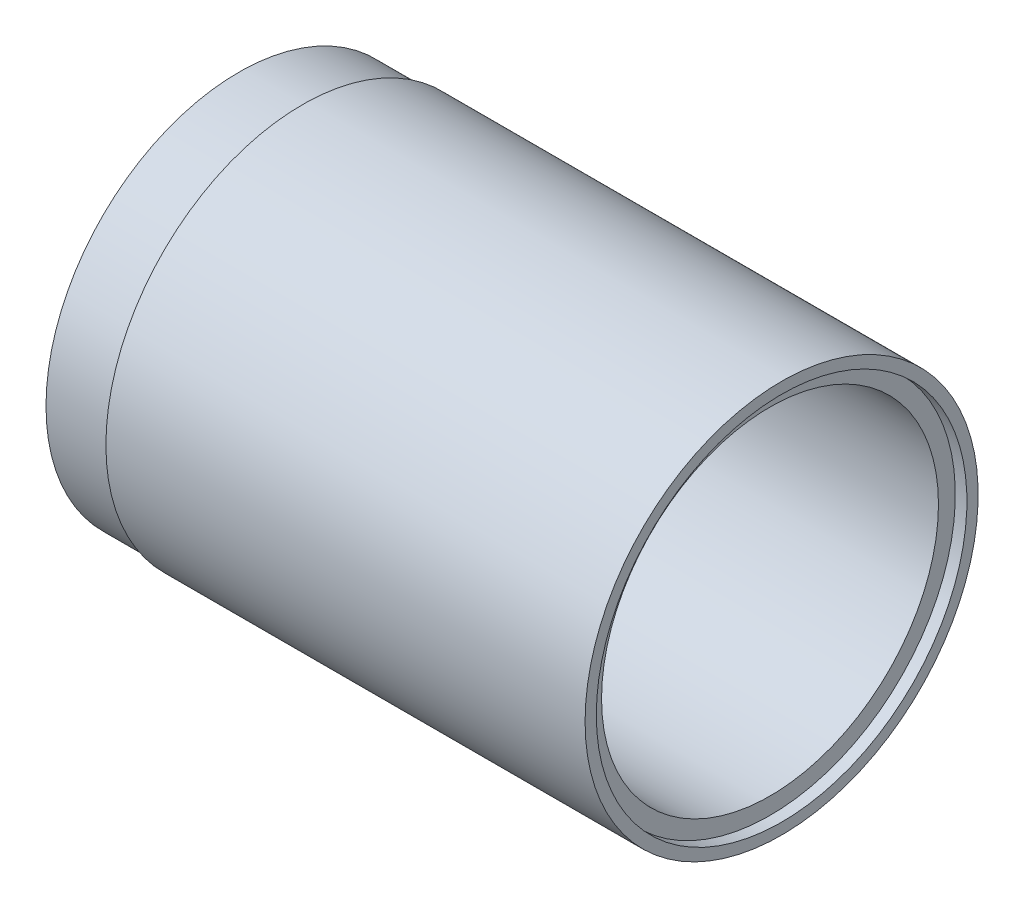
ISO-10303-21;
HEADER;
FILE_DESCRIPTION(('STEP AP214'),'2;1');
FILE_NAME('part.step','',(''),(''),'','','');
FILE_SCHEMA(('AUTOMOTIVE_DESIGN { 1 0 10303 214 1 1 1 1 }'));
ENDSEC;
DATA;
#1=APPLICATION_CONTEXT('core data for automotive mechanical design processes');
#2=APPLICATION_PROTOCOL_DEFINITION('international standard','automotive_design',2000,#1);
#3=PRODUCT_CONTEXT('',#1,'mechanical');
#4=PRODUCT('Part','Part','',(#3));
#5=PRODUCT_RELATED_PRODUCT_CATEGORY('part','',(#4));
#6=PRODUCT_DEFINITION_FORMATION('','',#4);
#7=PRODUCT_DEFINITION_CONTEXT('part definition',#1,'design');
#8=PRODUCT_DEFINITION('design','',#6,#7);
#9=PRODUCT_DEFINITION_SHAPE('','',#8);
#10=(LENGTH_UNIT() NAMED_UNIT(*) SI_UNIT(.MILLI.,.METRE.));
#11=(NAMED_UNIT(*) PLANE_ANGLE_UNIT() SI_UNIT($,.RADIAN.));
#12=(NAMED_UNIT(*) SI_UNIT($,.STERADIAN.) SOLID_ANGLE_UNIT());
#13=UNCERTAINTY_MEASURE_WITH_UNIT(LENGTH_MEASURE(1.E-05),#10,'distance_accuracy_value','');
#14=(GEOMETRIC_REPRESENTATION_CONTEXT(3) GLOBAL_UNCERTAINTY_ASSIGNED_CONTEXT((#13)) GLOBAL_UNIT_ASSIGNED_CONTEXT((#10,
#11,#12)) REPRESENTATION_CONTEXT('',''));
#15=CARTESIAN_POINT('',(0.,0.,0.));
#16=DIRECTION('',(0.,0.,1.));
#17=DIRECTION('',(1.,0.,0.));
#18=AXIS2_PLACEMENT_3D('',#15,#16,#17);
#19=CARTESIAN_POINT('',(0.,45.,0.));
#20=DIRECTION('',(1.,0.,0.));
#21=DIRECTION('',(0.,0.,-1.));
#22=AXIS2_PLACEMENT_3D('',#19,#20,#21);
#23=PLANE('',#22);
#24=CARTESIAN_POINT('',(0.,0.,0.));
#25=DIRECTION('',(-1.,0.,0.));
#26=DIRECTION('',(0.,0.,1.));
#27=AXIS2_PLACEMENT_3D('',#24,#25,#26);
#28=CIRCLE('',#27,45.);
#29=CARTESIAN_POINT('',(0.,0.,45.));
#30=VERTEX_POINT('',#29);
#31=EDGE_CURVE('E57',#30,#30,#28,.T.);
#32=ORIENTED_EDGE('',*,*,#31,.F.);
#33=EDGE_LOOP('',(#32));
#34=FACE_BOUND('',#33,.T.);
#35=CARTESIAN_POINT('',(0.,0.,0.));
#36=DIRECTION('',(-1.,0.,0.));
#37=DIRECTION('',(0.,0.,1.));
#38=AXIS2_PLACEMENT_3D('',#35,#36,#37);
#39=CIRCLE('',#38,51.5);
#40=CARTESIAN_POINT('',(0.,0.,51.5));
#41=VERTEX_POINT('',#40);
#42=EDGE_CURVE('E10',#41,#41,#39,.T.);
#43=ORIENTED_EDGE('',*,*,#42,.T.);
#44=EDGE_LOOP('',(#43));
#45=FACE_BOUND('',#44,.T.);
#46=ADVANCED_FACE('F29',(#34,#45),#23,.F.);
#47=CARTESIAN_POINT('',(0.,0.,0.));
#48=DIRECTION('',(-1.,0.,0.));
#49=DIRECTION('',(0.,0.,1.));
#50=AXIS2_PLACEMENT_3D('',#47,#48,#49);
#51=CYLINDRICAL_SURFACE('',#50,51.5);
#52=ORIENTED_EDGE('',*,*,#42,.F.);
#53=EDGE_LOOP('',(#52));
#54=FACE_BOUND('',#53,.T.);
#55=CARTESIAN_POINT('',(17.,0.,0.));
#56=DIRECTION('',(-1.,0.,0.));
#57=DIRECTION('',(0.,0.,1.));
#58=AXIS2_PLACEMENT_3D('',#55,#56,#57);
#59=CIRCLE('',#58,51.5);
#60=CARTESIAN_POINT('',(17.,0.,51.5));
#61=VERTEX_POINT('',#60);
#62=EDGE_CURVE('E35',#61,#61,#59,.T.);
#63=ORIENTED_EDGE('',*,*,#62,.T.);
#64=EDGE_LOOP('',(#63));
#65=FACE_BOUND('',#64,.T.);
#66=ADVANCED_FACE('F64',(#54,#65),#51,.T.);
#67=CARTESIAN_POINT('',(17.,51.5,0.));
#68=DIRECTION('',(1.,0.,0.));
#69=DIRECTION('',(0.,0.,-1.));
#70=AXIS2_PLACEMENT_3D('',#67,#68,#69);
#71=PLANE('',#70);
#72=ORIENTED_EDGE('',*,*,#62,.F.);
#73=EDGE_LOOP('',(#72));
#74=FACE_BOUND('',#73,.T.);
#75=CARTESIAN_POINT('',(17.,0.,0.));
#76=DIRECTION('',(-1.,0.,0.));
#77=DIRECTION('',(0.,0.,1.));
#78=AXIS2_PLACEMENT_3D('',#75,#76,#77);
#79=CIRCLE('',#78,52.5);
#80=CARTESIAN_POINT('',(17.,0.,52.5));
#81=VERTEX_POINT('',#80);
#82=EDGE_CURVE('E39',#81,#81,#79,.T.);
#83=ORIENTED_EDGE('',*,*,#82,.T.);
#84=EDGE_LOOP('',(#83));
#85=FACE_BOUND('',#84,.T.);
#86=ADVANCED_FACE('F68',(#74,#85),#71,.F.);
#87=CARTESIAN_POINT('',(0.,0.,0.));
#88=DIRECTION('',(-1.,0.,0.));
#89=DIRECTION('',(0.,0.,1.));
#90=AXIS2_PLACEMENT_3D('',#87,#88,#89);
#91=CYLINDRICAL_SURFACE('',#90,52.5);
#92=ORIENTED_EDGE('',*,*,#82,.F.);
#93=EDGE_LOOP('',(#92));
#94=FACE_BOUND('',#93,.T.);
#95=CARTESIAN_POINT('',(145.,0.,0.));
#96=DIRECTION('',(-1.,0.,0.));
#97=DIRECTION('',(0.,0.,1.));
#98=AXIS2_PLACEMENT_3D('',#95,#96,#97);
#99=CIRCLE('',#98,52.5);
#100=CARTESIAN_POINT('',(145.,0.,52.5));
#101=VERTEX_POINT('',#100);
#102=EDGE_CURVE('E43',#101,#101,#99,.T.);
#103=ORIENTED_EDGE('',*,*,#102,.T.);
#104=EDGE_LOOP('',(#103));
#105=FACE_BOUND('',#104,.T.);
#106=ADVANCED_FACE('F73',(#94,#105),#91,.T.);
#107=CARTESIAN_POINT('',(145.,52.5,0.));
#108=DIRECTION('',(-1.,0.,0.));
#109=DIRECTION('',(0.,0.,1.));
#110=AXIS2_PLACEMENT_3D('',#107,#108,#109);
#111=PLANE('',#110);
#112=ORIENTED_EDGE('',*,*,#102,.F.);
#113=EDGE_LOOP('',(#112));
#114=FACE_BOUND('',#113,.T.);
#115=CARTESIAN_POINT('',(145.,0.,0.));
#116=DIRECTION('',(-1.,0.,0.));
#117=DIRECTION('',(0.,0.,1.));
#118=AXIS2_PLACEMENT_3D('',#115,#116,#117);
#119=CIRCLE('',#118,49.4999999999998);
#120=CARTESIAN_POINT('',(145.,0.,49.4999999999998));
#121=VERTEX_POINT('',#120);
#122=EDGE_CURVE('E48',#121,#121,#119,.T.);
#123=ORIENTED_EDGE('',*,*,#122,.T.);
#124=EDGE_LOOP('',(#123));
#125=FACE_BOUND('',#124,.T.);
#126=ADVANCED_FACE('F79',(#114,#125),#111,.F.);
#127=CARTESIAN_POINT('',(0.,0.,0.));
#128=DIRECTION('',(-1.,0.,0.));
#129=DIRECTION('',(0.,0.,1.));
#130=AXIS2_PLACEMENT_3D('',#127,#128,#129);
#131=CYLINDRICAL_SURFACE('',#130,49.4999999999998);
#132=ORIENTED_EDGE('',*,*,#122,.F.);
#133=EDGE_LOOP('',(#132));
#134=FACE_BOUND('',#133,.T.);
#135=CARTESIAN_POINT('',(141.9,0.,0.));
#136=DIRECTION('',(-1.,0.,0.));
#137=DIRECTION('',(0.,0.,1.));
#138=AXIS2_PLACEMENT_3D('',#135,#136,#137);
#139=CIRCLE('',#138,49.4999999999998);
#140=CARTESIAN_POINT('',(141.9,0.,49.4999999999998));
#141=VERTEX_POINT('',#140);
#142=EDGE_CURVE('E51',#141,#141,#139,.T.);
#143=ORIENTED_EDGE('',*,*,#142,.T.);
#144=EDGE_LOOP('',(#143));
#145=FACE_BOUND('',#144,.T.);
#146=ADVANCED_FACE('F83',(#134,#145),#131,.F.);
#147=CARTESIAN_POINT('',(141.9,49.4999999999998,0.));
#148=DIRECTION('',(-1.,0.,0.));
#149=DIRECTION('',(0.,0.,1.));
#150=AXIS2_PLACEMENT_3D('',#147,#148,#149);
#151=PLANE('',#150);
#152=ORIENTED_EDGE('',*,*,#142,.F.);
#153=EDGE_LOOP('',(#152));
#154=FACE_BOUND('',#153,.T.);
#155=CARTESIAN_POINT('',(141.9,0.,0.));
#156=DIRECTION('',(-1.,0.,0.));
#157=DIRECTION('',(0.,0.,1.));
#158=AXIS2_PLACEMENT_3D('',#155,#156,#157);
#159=CIRCLE('',#158,44.9999999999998);
#160=CARTESIAN_POINT('',(141.9,0.,44.9999999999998));
#161=VERTEX_POINT('',#160);
#162=EDGE_CURVE('E54',#161,#161,#159,.T.);
#163=ORIENTED_EDGE('',*,*,#162,.T.);
#164=EDGE_LOOP('',(#163));
#165=FACE_BOUND('',#164,.T.);
#166=ADVANCED_FACE('F87',(#154,#165),#151,.F.);
#167=CARTESIAN_POINT('',(0.,0.,0.));
#168=DIRECTION('',(-1.,0.,0.));
#169=DIRECTION('',(0.,0.,1.));
#170=AXIS2_PLACEMENT_3D('',#167,#168,#169);
#171=CYLINDRICAL_SURFACE('',#170,44.9999999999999);
#172=ORIENTED_EDGE('',*,*,#162,.F.);
#173=EDGE_LOOP('',(#172));
#174=FACE_BOUND('',#173,.T.);
#175=ORIENTED_EDGE('',*,*,#31,.T.);
#176=EDGE_LOOP('',(#175));
#177=FACE_BOUND('',#176,.T.);
#178=ADVANCED_FACE('F61',(#174,#177),#171,.F.);
#179=CLOSED_SHELL('',(#46,#66,#86,#106,#126,#146,#166,#178));
#180=MANIFOLD_SOLID_BREP('B2',#179);
#181=ADVANCED_BREP_SHAPE_REPRESENTATION('',(#18,#180),#14);
#182=SHAPE_DEFINITION_REPRESENTATION(#9,#181);
ENDSEC;
END-ISO-10303-21;
